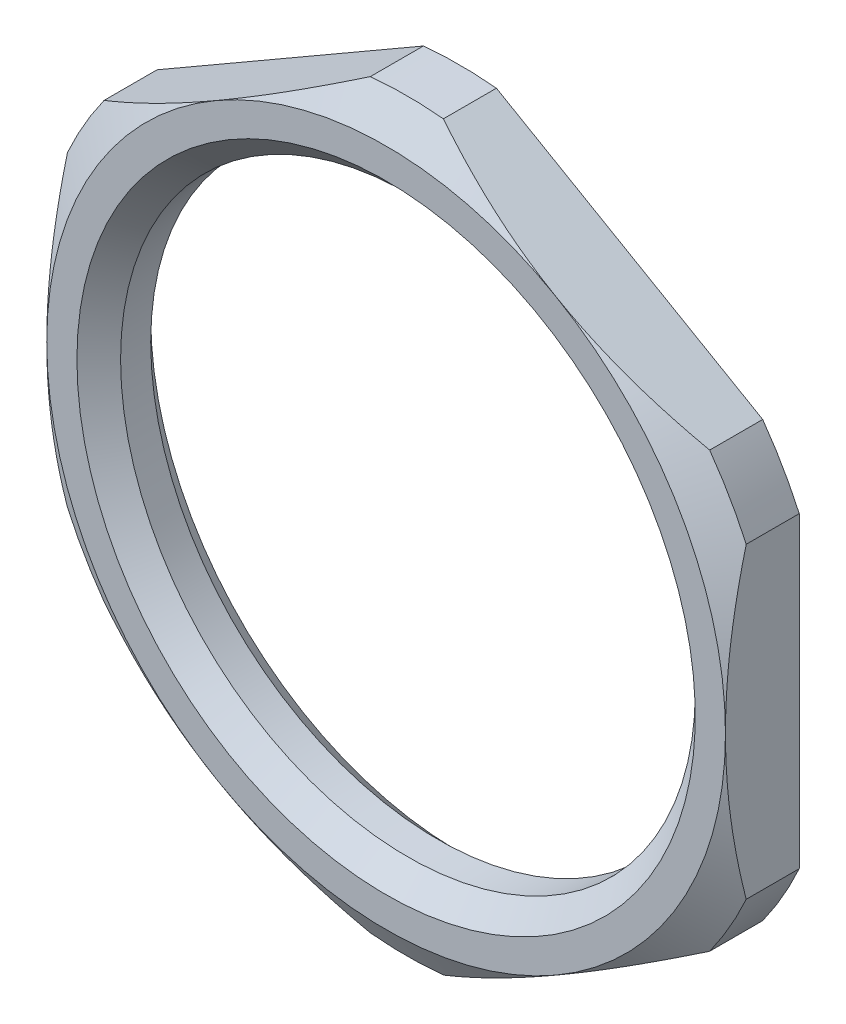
ISO-10303-21;
HEADER;
FILE_DESCRIPTION(('STEP AP214'),'2;1');
FILE_NAME('part.step','',(''),(''),'','','');
FILE_SCHEMA(('AUTOMOTIVE_DESIGN { 1 0 10303 214 1 1 1 1 }'));
ENDSEC;
DATA;
#1=APPLICATION_CONTEXT('core data for automotive mechanical design processes');
#2=APPLICATION_PROTOCOL_DEFINITION('international standard','automotive_design',2000,#1);
#3=PRODUCT_CONTEXT('',#1,'mechanical');
#4=PRODUCT('Part','Part','',(#3));
#5=PRODUCT_RELATED_PRODUCT_CATEGORY('part','',(#4));
#6=PRODUCT_DEFINITION_FORMATION('','',#4);
#7=PRODUCT_DEFINITION_CONTEXT('part definition',#1,'design');
#8=PRODUCT_DEFINITION('design','',#6,#7);
#9=PRODUCT_DEFINITION_SHAPE('','',#8);
#10=(LENGTH_UNIT() NAMED_UNIT(*) SI_UNIT(.MILLI.,.METRE.));
#11=(NAMED_UNIT(*) PLANE_ANGLE_UNIT() SI_UNIT($,.RADIAN.));
#12=(NAMED_UNIT(*) SI_UNIT($,.STERADIAN.) SOLID_ANGLE_UNIT());
#13=UNCERTAINTY_MEASURE_WITH_UNIT(LENGTH_MEASURE(1.E-05),#10,'distance_accuracy_value','');
#14=(GEOMETRIC_REPRESENTATION_CONTEXT(3) GLOBAL_UNCERTAINTY_ASSIGNED_CONTEXT((#13)) GLOBAL_UNIT_ASSIGNED_CONTEXT((#10,
#11,#12)) REPRESENTATION_CONTEXT('',''));
#15=CARTESIAN_POINT('',(0.,0.,0.));
#16=DIRECTION('',(0.,0.,1.));
#17=DIRECTION('',(1.,0.,0.));
#18=AXIS2_PLACEMENT_3D('',#15,#16,#17);
#19=CARTESIAN_POINT('',(0.,20.955,0.));
#20=DIRECTION('',(0.,0.,-1.));
#21=DIRECTION('',(-1.,0.,0.));
#22=AXIS2_PLACEMENT_3D('',#19,#20,#21);
#23=PLANE('',#22);
#24=DIRECTION('',(-0.866025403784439,-0.5,0.));
#25=VECTOR('',#24,1.);
#26=CARTESIAN_POINT('',(-2.42621883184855,25.1573342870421,0.));
#27=LINE('',#26,#25);
#28=CARTESIAN_POINT('',(-2.47659293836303,25.1282507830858,0.));
#29=VERTEX_POINT('',#28);
#30=CARTESIAN_POINT('',(-20.523407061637,14.7089177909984,0.));
#31=VERTEX_POINT('',#30);
#32=EDGE_CURVE('E389',#29,#31,#27,.T.);
#33=ORIENTED_EDGE('',*,*,#32,.F.);
#34=CARTESIAN_POINT('',(0.,3.57353036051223E-13,0.));
#35=DIRECTION('',(0.,0.,-1.));
#36=DIRECTION('',(-1.,0.,0.));
#37=AXIS2_PLACEMENT_3D('',#34,#35,#36);
#38=CIRCLE('',#37,25.2499999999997);
#39=CARTESIAN_POINT('',(2.47659293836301,25.1282507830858,0.));
#40=VERTEX_POINT('',#39);
#41=EDGE_CURVE('E391',#40,#29,#38,.F.);
#42=ORIENTED_EDGE('',*,*,#41,.F.);
#43=DIRECTION('',(-0.866025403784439,0.5,0.));
#44=VECTOR('',#43,1.);
#45=CARTESIAN_POINT('',(2.42621883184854,25.1573342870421,0.));
#46=LINE('',#45,#44);
#47=CARTESIAN_POINT('',(20.523407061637,14.7089177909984,0.));
#48=VERTEX_POINT('',#47);
#49=EDGE_CURVE('E147',#48,#40,#46,.T.);
#50=ORIENTED_EDGE('',*,*,#49,.F.);
#51=CARTESIAN_POINT('',(2.08166817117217E-13,1.07552855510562E-13,0.));
#52=DIRECTION('',(0.,0.,-1.));
#53=DIRECTION('',(-1.,0.,0.));
#54=AXIS2_PLACEMENT_3D('',#51,#52,#53);
#55=CIRCLE('',#54,25.25);
#56=CARTESIAN_POINT('',(23.,10.4193329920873,0.));
#57=VERTEX_POINT('',#56);
#58=EDGE_CURVE('E140',#57,#48,#55,.F.);
#59=ORIENTED_EDGE('',*,*,#58,.F.);
#60=DIRECTION('',(0.,1.,0.));
#61=VECTOR('',#60,1.);
#62=CARTESIAN_POINT('',(23.,20.955,0.));
#63=LINE('',#62,#61);
#64=CARTESIAN_POINT('',(23.,-10.4193329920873,0.));
#65=VERTEX_POINT('',#64);
#66=EDGE_CURVE('E130',#65,#57,#63,.T.);
#67=ORIENTED_EDGE('',*,*,#66,.F.);
#68=CARTESIAN_POINT('',(7.21644966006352E-13,-4.16333634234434E-13,0.));
#69=DIRECTION('',(0.,0.,-1.));
#70=DIRECTION('',(-1.,0.,0.));
#71=AXIS2_PLACEMENT_3D('',#68,#69,#70);
#72=CIRCLE('',#71,25.2499999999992);
#73=CARTESIAN_POINT('',(20.523407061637,-14.7089177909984,0.));
#74=VERTEX_POINT('',#73);
#75=EDGE_CURVE('E119',#74,#65,#72,.F.);
#76=ORIENTED_EDGE('',*,*,#75,.F.);
#77=DIRECTION('',(0.866025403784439,0.5,0.));
#78=VECTOR('',#77,1.);
#79=CARTESIAN_POINT('',(20.5737811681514,-14.6798342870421,0.));
#80=LINE('',#79,#78);
#81=CARTESIAN_POINT('',(2.47659293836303,-25.1282507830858,0.));
#82=VERTEX_POINT('',#81);
#83=EDGE_CURVE('E124',#82,#74,#80,.T.);
#84=ORIENTED_EDGE('',*,*,#83,.F.);
#85=CARTESIAN_POINT('',(0.,-1.03389519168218E-12,0.));
#86=DIRECTION('',(0.,0.,-1.));
#87=DIRECTION('',(-1.,0.,0.));
#88=AXIS2_PLACEMENT_3D('',#85,#86,#87);
#89=CIRCLE('',#88,25.249999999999);
#90=CARTESIAN_POINT('',(-2.47659293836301,-25.1282507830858,0.));
#91=VERTEX_POINT('',#90);
#92=EDGE_CURVE('E379',#91,#82,#89,.F.);
#93=ORIENTED_EDGE('',*,*,#92,.F.);
#94=DIRECTION('',(0.866025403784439,-0.5,0.));
#95=VECTOR('',#94,1.);
#96=CARTESIAN_POINT('',(-20.5737811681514,-14.6798342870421,0.));
#97=LINE('',#96,#95);
#98=CARTESIAN_POINT('',(-20.523407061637,-14.7089177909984,0.));
#99=VERTEX_POINT('',#98);
#100=EDGE_CURVE('E381',#99,#91,#97,.T.);
#101=ORIENTED_EDGE('',*,*,#100,.F.);
#102=CARTESIAN_POINT('',(-4.26741975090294E-13,-2.46330733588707E-13,0.));
#103=DIRECTION('',(0.,0.,-1.));
#104=DIRECTION('',(-1.,0.,0.));
#105=AXIS2_PLACEMENT_3D('',#102,#103,#104);
#106=CIRCLE('',#105,25.2499999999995);
#107=CARTESIAN_POINT('',(-23.,-10.4193329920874,0.));
#108=VERTEX_POINT('',#107);
#109=EDGE_CURVE('E383',#108,#99,#106,.F.);
#110=ORIENTED_EDGE('',*,*,#109,.F.);
#111=DIRECTION('',(0.,-1.,0.));
#112=VECTOR('',#111,1.);
#113=CARTESIAN_POINT('',(-23.,20.955,0.));
#114=LINE('',#113,#112);
#115=CARTESIAN_POINT('',(-23.,10.4193329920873,0.));
#116=VERTEX_POINT('',#115);
#117=EDGE_CURVE('E385',#116,#108,#114,.T.);
#118=ORIENTED_EDGE('',*,*,#117,.F.);
#119=CARTESIAN_POINT('',(-9.64506252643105E-13,5.56846235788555E-13,0.));
#120=DIRECTION('',(0.,0.,-1.));
#121=DIRECTION('',(-1.,0.,0.));
#122=AXIS2_PLACEMENT_3D('',#119,#120,#121);
#123=CIRCLE('',#122,25.2499999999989);
#124=EDGE_CURVE('E387',#31,#116,#123,.F.);
#125=ORIENTED_EDGE('',*,*,#124,.F.);
#126=EDGE_LOOP('',(#33,#42,#50,#59,#67,#76,#84,#93,#101,#110,#118,#125));
#127=FACE_BOUND('',#126,.T.);
#128=CARTESIAN_POINT('',(0.,0.,0.));
#129=DIRECTION('',(0.,0.,-1.));
#130=DIRECTION('',(-1.,0.,0.));
#131=AXIS2_PLACEMENT_3D('',#128,#129,#130);
#132=CIRCLE('',#131,20.955);
#133=CARTESIAN_POINT('',(-20.955,0.,0.));
#134=VERTEX_POINT('',#133);
#135=EDGE_CURVE('E152',#134,#134,#132,.T.);
#136=ORIENTED_EDGE('',*,*,#135,.F.);
#137=EDGE_LOOP('',(#136));
#138=FACE_BOUND('',#137,.T.);
#139=ADVANCED_FACE('F14',(#127,#138),#23,.T.);
#140=CARTESIAN_POINT('',(0.,0.,0.));
#141=DIRECTION('',(0.,0.,-1.));
#142=DIRECTION('',(-1.,0.,0.));
#143=AXIS2_PLACEMENT_3D('',#140,#141,#142);
#144=CONICAL_SURFACE('',#143,31.0016726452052,1.01229096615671);
#145=CARTESIAN_POINT('',(0.,0.,3.59404395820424));
#146=DIRECTION('',(0.,0.,-1.));
#147=DIRECTION('',(-1.,0.,0.));
#148=AXIS2_PLACEMENT_3D('',#145,#146,#147);
#149=CIRCLE('',#148,25.2499999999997);
#150=CARTESIAN_POINT('',(-2.47659293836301,25.1282507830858,3.59404395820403));
#151=VERTEX_POINT('',#150);
#152=CARTESIAN_POINT('',(2.47659293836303,25.1282507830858,3.59404395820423));
#153=VERTEX_POINT('',#152);
#154=EDGE_CURVE('E18',#151,#153,#149,.T.);
#155=ORIENTED_EDGE('',*,*,#154,.F.);
#156=CARTESIAN_POINT('',(-20.523607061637,14.7088023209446,3.59398440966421));
#157=CARTESIAN_POINT('',(-20.0323767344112,14.9924142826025,3.74026185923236));
#158=CARTESIAN_POINT('',(-19.5389969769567,15.2772672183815,3.87724127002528));
#159=CARTESIAN_POINT('',(-18.5480826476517,15.8493718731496,4.13045958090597));
#160=CARTESIAN_POINT('',(-18.0505466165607,16.1366244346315,4.24669084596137));
#161=CARTESIAN_POINT('',(-17.0511867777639,16.7136051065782,4.45629164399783));
#162=CARTESIAN_POINT('',(-16.5493583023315,17.0033359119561,4.54963176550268));
#163=CARTESIAN_POINT('',(-15.5427269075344,17.584514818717,4.71124140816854));
#164=CARTESIAN_POINT('',(-15.0379243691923,17.8759627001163,4.7795140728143));
#165=CARTESIAN_POINT('',(-14.0375910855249,18.4535053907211,4.88813161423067));
#166=CARTESIAN_POINT('',(-13.5421093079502,18.7395719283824,4.92907402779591));
#167=CARTESIAN_POINT('',(-12.5500053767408,19.3123634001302,4.98446926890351));
#168=CARTESIAN_POINT('',(-12.0533831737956,19.5990883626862,4.99892092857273));
#169=CARTESIAN_POINT('',(-11.0605465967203,20.1723028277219,5.00096152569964));
#170=CARTESIAN_POINT('',(-10.5643322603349,20.4587923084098,4.98857476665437));
#171=CARTESIAN_POINT('',(-9.57298362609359,21.0311477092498,4.93730659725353));
#172=CARTESIAN_POINT('',(-9.07784923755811,21.3170136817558,4.89842750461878));
#173=CARTESIAN_POINT('',(-8.07144022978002,21.8980641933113,4.79323232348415));
#174=CARTESIAN_POINT('',(-7.56024092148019,22.1932052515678,4.72596073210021));
#175=CARTESIAN_POINT('',(-6.54086762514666,22.7817406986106,4.56561593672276));
#176=CARTESIAN_POINT('',(-6.03269387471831,23.0751349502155,4.47254073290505));
#177=CARTESIAN_POINT('',(-5.01389388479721,23.6633393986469,4.26137401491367));
#178=CARTESIAN_POINT('',(-4.50331332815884,23.958123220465,4.14299123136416));
#179=CARTESIAN_POINT('',(-3.48653142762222,24.545162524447,3.88432356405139));
#180=CARTESIAN_POINT('',(-2.98032841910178,24.8374189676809,3.74404743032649));
#181=CARTESIAN_POINT('',(-2.47639293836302,25.1283662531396,3.59398440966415));
#182=B_SPLINE_CURVE_WITH_KNOTS('',3,(#156,#157,#158,#159,#160,#161,#162,#163,#164,#165,#166,
#167,#168,#169,#170,#171,#172,#173,#174,#175,#176,#177,#178,#179,#180,#181),.UNSPECIFIED.,.F.,
.F.,(4,2,2,2,2,2,2,2,2,2,2,2,4),(0.,1.75738751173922,3.51542039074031,5.27570036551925,
7.03575952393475,8.75595349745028,10.4762233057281,12.1949359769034,13.9134983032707,
15.6951969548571,17.4770337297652,19.2806029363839,21.0834531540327),.UNSPECIFIED.);
#183=CARTESIAN_POINT('',(-11.5,19.9185842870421,5.));
#184=VERTEX_POINT('',#183);
#185=EDGE_CURVE('E9',#184,#151,#182,.T.);
#186=ORIENTED_EDGE('',*,*,#185,.F.);
#187=CARTESIAN_POINT('',(0.,0.,5.));
#188=DIRECTION('',(0.,0.,-1.));
#189=DIRECTION('',(-1.,0.,0.));
#190=AXIS2_PLACEMENT_3D('',#187,#188,#189);
#191=CIRCLE('',#190,23.);
#192=CARTESIAN_POINT('',(11.5,19.9185842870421,5.));
#193=VERTEX_POINT('',#192);
#194=EDGE_CURVE('E146',#184,#193,#191,.T.);
#195=ORIENTED_EDGE('',*,*,#194,.T.);
#196=CARTESIAN_POINT('',(2.47639293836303,25.1283662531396,3.59398440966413));
#197=CARTESIAN_POINT('',(2.96762326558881,24.8447542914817,3.74026185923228));
#198=CARTESIAN_POINT('',(3.46100302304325,24.5599013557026,3.87724127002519));
#199=CARTESIAN_POINT('',(4.4519173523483,23.9877967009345,4.13045958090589));
#200=CARTESIAN_POINT('',(4.94945338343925,23.7005441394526,4.24669084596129));
#201=CARTESIAN_POINT('',(5.94881322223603,23.123563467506,4.45629164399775));
#202=CARTESIAN_POINT('',(6.45064169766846,22.8338326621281,4.5496317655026));
#203=CARTESIAN_POINT('',(7.45727309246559,22.2526537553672,4.71124140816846));
#204=CARTESIAN_POINT('',(7.96207563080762,21.9612058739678,4.77951407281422));
#205=CARTESIAN_POINT('',(8.9624089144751,21.3836631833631,4.88813161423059));
#206=CARTESIAN_POINT('',(9.45789069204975,21.0975966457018,4.92907402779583));
#207=CARTESIAN_POINT('',(10.4499946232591,20.524805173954,4.98446926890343));
#208=CARTESIAN_POINT('',(10.9466168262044,20.238080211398,4.99892092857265));
#209=CARTESIAN_POINT('',(11.9394534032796,19.6648657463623,5.00096152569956));
#210=CARTESIAN_POINT('',(12.4356677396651,19.3783762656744,4.98857476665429));
#211=CARTESIAN_POINT('',(13.4270163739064,18.8060208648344,4.93730659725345));
#212=CARTESIAN_POINT('',(13.9221507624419,18.5201548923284,4.89842750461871));
#213=CARTESIAN_POINT('',(14.92855977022,17.9391043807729,4.79323232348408));
#214=CARTESIAN_POINT('',(15.4397590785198,17.6439633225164,4.72596073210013));
#215=CARTESIAN_POINT('',(16.4591323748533,17.0554278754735,4.56561593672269));
#216=CARTESIAN_POINT('',(16.9673061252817,16.7620336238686,4.47254073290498));
#217=CARTESIAN_POINT('',(17.9861061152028,16.1738291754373,4.2613740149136));
#218=CARTESIAN_POINT('',(18.4966866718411,15.8790453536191,4.14299123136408));
#219=CARTESIAN_POINT('',(19.5134685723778,15.2920060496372,3.88432356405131));
#220=CARTESIAN_POINT('',(20.0196715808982,14.9997496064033,3.74404743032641));
#221=CARTESIAN_POINT('',(20.523607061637,14.7088023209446,3.59398440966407));
#222=B_SPLINE_CURVE_WITH_KNOTS('',3,(#196,#197,#198,#199,#200,#201,#202,#203,#204,#205,#206,
#207,#208,#209,#210,#211,#212,#213,#214,#215,#216,#217,#218,#219,#220,#221),.UNSPECIFIED.,.F.,
.F.,(4,2,2,2,2,2,2,2,2,2,2,2,4),(0.,1.75738751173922,3.51542039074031,5.27570036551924,
7.03575952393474,8.75595349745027,10.4762233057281,12.1949359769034,13.9134983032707,
15.6951969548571,17.4770337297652,19.2806029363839,21.0834531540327),.UNSPECIFIED.);
#223=EDGE_CURVE('E252',#153,#193,#222,.T.);
#224=ORIENTED_EDGE('',*,*,#223,.F.);
#225=EDGE_LOOP('',(#155,#186,#195,#224));
#226=FACE_BOUND('',#225,.T.);
#227=ADVANCED_FACE('F199',(#226),#144,.T.);
#228=CARTESIAN_POINT('',(-20.523407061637,14.7089177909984,3.59404395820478));
#229=VERTEX_POINT('',#228);
#230=EDGE_CURVE('E23',#229,#184,#182,.T.);
#231=ORIENTED_EDGE('',*,*,#230,.F.);
#232=CARTESIAN_POINT('',(0.,0.,3.59404395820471));
#233=DIRECTION('',(0.,0.,-1.));
#234=DIRECTION('',(-1.,0.,0.));
#235=AXIS2_PLACEMENT_3D('',#232,#233,#234);
#236=CIRCLE('',#235,25.2499999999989);
#237=CARTESIAN_POINT('',(-23.,10.4193329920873,3.59404395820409));
#238=VERTEX_POINT('',#237);
#239=EDGE_CURVE('E246',#238,#229,#236,.T.);
#240=ORIENTED_EDGE('',*,*,#239,.F.);
#241=CARTESIAN_POINT('',(-23.,-31.8496519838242,-5.17670605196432));
#242=CARTESIAN_POINT('',(-23.,-31.4564864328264,-4.97753601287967));
#243=CARTESIAN_POINT('',(-23.,-31.0628139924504,-4.77936724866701));
#244=CARTESIAN_POINT('',(-23.,-30.2743710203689,-4.38521833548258));
#245=CARTESIAN_POINT('',(-23.,-29.8796004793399,-4.18923820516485));
#246=CARTESIAN_POINT('',(-23.,-28.6934436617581,-3.60482471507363));
#247=CARTESIAN_POINT('',(-23.,-27.900293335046,-3.21995945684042));
#248=CARTESIAN_POINT('',(-23.,-26.3063044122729,-2.46050503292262));
#249=CARTESIAN_POINT('',(-23.,-25.505450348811,-2.08594827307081));
#250=CARTESIAN_POINT('',(-23.,-23.8974654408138,-1.35058536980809));
#251=CARTESIAN_POINT('',(-23.,-23.0903347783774,-0.989778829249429));
#252=CARTESIAN_POINT('',(-23.,-21.4417152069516,-0.273015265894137));
#253=CARTESIAN_POINT('',(-23.,-20.5999795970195,0.0823765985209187));
#254=CARTESIAN_POINT('',(-23.,-18.9075684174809,0.771407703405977));
#255=CARTESIAN_POINT('',(-23.,-18.0568924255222,1.10504591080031));
#256=CARTESIAN_POINT('',(-23.,-16.3462024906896,1.74525566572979));
#257=CARTESIAN_POINT('',(-23.,-15.4861975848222,2.05185116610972));
#258=CARTESIAN_POINT('',(-23.,-13.7552474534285,2.6321040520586));
#259=CARTESIAN_POINT('',(-23.,-12.8843036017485,2.90576552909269));
#260=CARTESIAN_POINT('',(-23.,-10.8538744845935,3.49291166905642));
#261=CARTESIAN_POINT('',(-23.,-9.69001120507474,3.79173913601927));
#262=CARTESIAN_POINT('',(-23.,-7.92996265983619,4.1736406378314));
#263=CARTESIAN_POINT('',(-23.,-7.34089843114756,4.28988532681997));
#264=CARTESIAN_POINT('',(-23.,-6.15842397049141,4.49794565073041));
#265=CARTESIAN_POINT('',(-23.,-5.56501376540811,4.58976143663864));
#266=CARTESIAN_POINT('',(-23.,-4.38267576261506,4.74579999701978));
#267=CARTESIAN_POINT('',(-23.,-3.79379498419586,4.81037719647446));
#268=CARTESIAN_POINT('',(-23.,-2.6136556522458,4.91211160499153));
#269=CARTESIAN_POINT('',(-23.,-2.02239712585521,4.94926912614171));
#270=CARTESIAN_POINT('',(-23.,-0.838828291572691,4.99518061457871));
#271=CARTESIAN_POINT('',(-23.,-0.246518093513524,5.00393739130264));
#272=CARTESIAN_POINT('',(-23.,0.937832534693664,4.99281676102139));
#273=CARTESIAN_POINT('',(-23.,1.5298729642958,4.97293929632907));
#274=CARTESIAN_POINT('',(-23.,2.71203937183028,4.90510435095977));
#275=CARTESIAN_POINT('',(-23.,3.30216614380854,4.85716059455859));
#276=CARTESIAN_POINT('',(-23.,4.47960619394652,4.73444095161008));
#277=CARTESIAN_POINT('',(-23.,5.06691944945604,4.65966484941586));
#278=CARTESIAN_POINT('',(-23.,6.23789513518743,4.48504287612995));
#279=CARTESIAN_POINT('',(-23.,6.82155684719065,4.38519222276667));
#280=CARTESIAN_POINT('',(-23.,7.98452759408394,4.16253924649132));
#281=CARTESIAN_POINT('',(-23.,8.56383611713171,4.03973426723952));
#282=CARTESIAN_POINT('',(-23.,9.72515392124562,3.77172646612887));
#283=CARTESIAN_POINT('',(-23.,10.3071004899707,3.62625335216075));
#284=CARTESIAN_POINT('',(-23.,11.4659179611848,3.31646421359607));
#285=CARTESIAN_POINT('',(-23.,12.0427889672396,3.15214857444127));
#286=CARTESIAN_POINT('',(-23.,13.191488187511,2.80692461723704));
#287=CARTESIAN_POINT('',(-23.,13.7633166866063,2.62601724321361));
#288=CARTESIAN_POINT('',(-23.,14.9021426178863,2.24965887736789));
#289=CARTESIAN_POINT('',(-23.,15.4691400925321,2.05420801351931));
#290=CARTESIAN_POINT('',(-23.,16.7228247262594,1.60620786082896));
#291=CARTESIAN_POINT('',(-23.,17.4084017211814,1.35055656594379));
#292=CARTESIAN_POINT('',(-23.,18.7733636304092,0.823250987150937));
#293=CARTESIAN_POINT('',(-23.,19.4527484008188,0.551596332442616));
#294=CARTESIAN_POINT('',(-23.,20.8060603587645,-0.00533185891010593));
#295=CARTESIAN_POINT('',(-23.,21.4799863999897,-0.290608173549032));
#296=CARTESIAN_POINT('',(-23.,22.8228402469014,-0.872693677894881));
#297=CARTESIAN_POINT('',(-23.,23.4917679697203,-1.16950305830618));
#298=CARTESIAN_POINT('',(-23.,24.8069673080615,-1.76471950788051));
#299=CARTESIAN_POINT('',(-23.,25.4533589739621,-2.0628618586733));
#300=CARTESIAN_POINT('',(-23.,26.7423909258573,-2.66715633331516));
#301=CARTESIAN_POINT('',(-23.,27.3850311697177,-2.97330854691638));
#302=CARTESIAN_POINT('',(-23.,28.6663897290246,-3.59224376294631));
#303=CARTESIAN_POINT('',(-23.,29.3051110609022,-3.90502053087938));
#304=CARTESIAN_POINT('',(-23.,30.5795428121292,-4.53657736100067));
#305=CARTESIAN_POINT('',(-23.,31.2152533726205,-4.85535713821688));
#306=CARTESIAN_POINT('',(-23.,31.8496519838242,-5.17670605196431));
#307=B_SPLINE_CURVE_WITH_KNOTS('',3,(#241,#242,#243,#244,#245,#246,#247,#248,#249,#250,#251,
#252,#253,#254,#255,#256,#257,#258,#259,#260,#261,#262,#263,#264,#265,#266,#267,#268,#269,#270,
#271,#272,#273,#274,#275,#276,#277,#278,#279,#280,#281,#282,#283,#284,#285,#286,#287,#288,#289,
#290,#291,#292,#293,#294,#295,#296,#297,#298,#299,#300,#301,#302,#303,#304,#305,#306),
.UNSPECIFIED.,.F.,.F.,(4,2,2,2,2,2,2,2,2,2,2,2,2,2,2,2,2,2,2,2,2,2,2,2,2,2,2,2,2,2,2,2,4),(0.,
1.32220408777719,2.64441943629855,5.28912313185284,7.94136272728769,10.5935256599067,
13.3343333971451,16.0752711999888,18.813756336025,21.5519009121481,25.1535400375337,
26.9543944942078,28.7552378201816,30.5318663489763,32.3084746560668,34.0849072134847,
35.8613433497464,37.6369115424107,39.4124940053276,41.1884153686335,42.9645423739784,
44.7637473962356,46.5629156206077,48.3619815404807,50.1610316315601,52.3558618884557,
54.5507430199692,56.7460737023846,58.9414407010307,61.076887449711,63.2123581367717,
65.3459013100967,67.4793434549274),.UNSPECIFIED.);
#308=CARTESIAN_POINT('',(-23.,0.,5.00000000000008));
#309=VERTEX_POINT('',#308);
#310=EDGE_CURVE('E248',#309,#238,#307,.T.);
#311=ORIENTED_EDGE('',*,*,#310,.F.);
#312=EDGE_CURVE('E141',#309,#184,#191,.T.);
#313=ORIENTED_EDGE('',*,*,#312,.T.);
#314=EDGE_LOOP('',(#231,#240,#311,#313));
#315=FACE_BOUND('',#314,.T.);
#316=ADVANCED_FACE('F204',(#315),#144,.T.);
#317=CARTESIAN_POINT('',(20.523407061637,14.7089177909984,3.59404395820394));
#318=VERTEX_POINT('',#317);
#319=EDGE_CURVE('E256',#193,#318,#222,.T.);
#320=ORIENTED_EDGE('',*,*,#319,.F.);
#321=CARTESIAN_POINT('',(23.,0.,4.99999999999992));
#322=VERTEX_POINT('',#321);
#323=EDGE_CURVE('E153',#193,#322,#191,.T.);
#324=ORIENTED_EDGE('',*,*,#323,.T.);
#325=CARTESIAN_POINT('',(23.,31.8496519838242,-5.17670605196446));
#326=CARTESIAN_POINT('',(23.,31.4564864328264,-4.97753601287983));
#327=CARTESIAN_POINT('',(23.,31.0628139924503,-4.77936724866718));
#328=CARTESIAN_POINT('',(23.,30.2743710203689,-4.38521833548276));
#329=CARTESIAN_POINT('',(23.,29.8796004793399,-4.18923820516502));
#330=CARTESIAN_POINT('',(23.,28.693443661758,-3.60482471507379));
#331=CARTESIAN_POINT('',(23.,27.900293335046,-3.21995945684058));
#332=CARTESIAN_POINT('',(23.,26.3063044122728,-2.46050503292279));
#333=CARTESIAN_POINT('',(23.,25.505450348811,-2.08594827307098));
#334=CARTESIAN_POINT('',(23.,23.8974654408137,-1.35058536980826));
#335=CARTESIAN_POINT('',(23.,23.0903347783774,-0.989778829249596));
#336=CARTESIAN_POINT('',(23.,21.4417152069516,-0.273015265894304));
#337=CARTESIAN_POINT('',(23.,20.5999795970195,0.0823765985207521));
#338=CARTESIAN_POINT('',(23.,18.9075684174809,0.771407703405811));
#339=CARTESIAN_POINT('',(23.,18.0568924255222,1.10504591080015));
#340=CARTESIAN_POINT('',(23.,16.3462024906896,1.74525566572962));
#341=CARTESIAN_POINT('',(23.,15.4861975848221,2.05185116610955));
#342=CARTESIAN_POINT('',(23.,13.7552474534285,2.63210405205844));
#343=CARTESIAN_POINT('',(23.,12.8843036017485,2.90576552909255));
#344=CARTESIAN_POINT('',(23.,10.8538744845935,3.49291166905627));
#345=CARTESIAN_POINT('',(23.,9.6900112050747,3.7917391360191));
#346=CARTESIAN_POINT('',(23.,7.92996265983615,4.17364063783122));
#347=CARTESIAN_POINT('',(23.,7.34089843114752,4.28988532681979));
#348=CARTESIAN_POINT('',(23.,6.15842397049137,4.49794565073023));
#349=CARTESIAN_POINT('',(23.,5.56501376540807,4.58976143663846));
#350=CARTESIAN_POINT('',(23.,4.38267576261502,4.74579999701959));
#351=CARTESIAN_POINT('',(23.,3.79379498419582,4.81037719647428));
#352=CARTESIAN_POINT('',(23.,2.61365565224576,4.91211160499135));
#353=CARTESIAN_POINT('',(23.,2.02239712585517,4.94926912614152));
#354=CARTESIAN_POINT('',(23.,0.83882829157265,4.99518061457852));
#355=CARTESIAN_POINT('',(23.,0.246518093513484,5.00393739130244));
#356=CARTESIAN_POINT('',(23.,-0.937832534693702,4.99281676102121));
#357=CARTESIAN_POINT('',(23.,-1.52987296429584,4.97293929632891));
#358=CARTESIAN_POINT('',(23.,-2.71203937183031,4.90510435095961));
#359=CARTESIAN_POINT('',(23.,-3.30216614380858,4.85716059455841));
#360=CARTESIAN_POINT('',(23.,-4.47960619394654,4.73444095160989));
#361=CARTESIAN_POINT('',(23.,-5.06691944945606,4.65966484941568));
#362=CARTESIAN_POINT('',(23.,-6.23789513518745,4.48504287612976));
#363=CARTESIAN_POINT('',(23.,-6.82155684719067,4.38519222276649));
#364=CARTESIAN_POINT('',(23.,-7.98452759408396,4.16253924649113));
#365=CARTESIAN_POINT('',(23.,-8.56383611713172,4.03973426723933));
#366=CARTESIAN_POINT('',(23.,-9.72515392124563,3.77172646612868));
#367=CARTESIAN_POINT('',(23.,-10.3071004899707,3.62625335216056));
#368=CARTESIAN_POINT('',(23.,-11.4659179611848,3.31646421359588));
#369=CARTESIAN_POINT('',(23.,-12.0427889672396,3.15214857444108));
#370=CARTESIAN_POINT('',(23.,-13.191488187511,2.80692461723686));
#371=CARTESIAN_POINT('',(23.,-13.7633166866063,2.62601724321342));
#372=CARTESIAN_POINT('',(23.,-14.9021426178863,2.24965887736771));
#373=CARTESIAN_POINT('',(23.,-15.4691400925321,2.05420801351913));
#374=CARTESIAN_POINT('',(23.,-16.7228247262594,1.60620786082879));
#375=CARTESIAN_POINT('',(23.,-17.4084017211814,1.35055656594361));
#376=CARTESIAN_POINT('',(23.,-18.7733636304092,0.823250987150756));
#377=CARTESIAN_POINT('',(23.,-19.4527484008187,0.551596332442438));
#378=CARTESIAN_POINT('',(23.,-20.8060603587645,-0.00533185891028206));
#379=CARTESIAN_POINT('',(23.,-21.4799863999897,-0.29060817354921));
#380=CARTESIAN_POINT('',(23.,-22.8228402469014,-0.872693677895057));
#381=CARTESIAN_POINT('',(23.,-23.4917679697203,-1.16950305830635));
#382=CARTESIAN_POINT('',(23.,-24.8069673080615,-1.76471950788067));
#383=CARTESIAN_POINT('',(23.,-25.4533589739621,-2.06286185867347));
#384=CARTESIAN_POINT('',(23.,-26.7423909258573,-2.66715633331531));
#385=CARTESIAN_POINT('',(23.,-27.3850311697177,-2.97330854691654));
#386=CARTESIAN_POINT('',(23.,-28.6663897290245,-3.59224376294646));
#387=CARTESIAN_POINT('',(23.,-29.3051110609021,-3.90502053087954));
#388=CARTESIAN_POINT('',(23.,-30.5795428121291,-4.53657736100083));
#389=CARTESIAN_POINT('',(23.,-31.2152533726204,-4.85535713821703));
#390=CARTESIAN_POINT('',(23.,-31.8496519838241,-5.17670605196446));
#391=B_SPLINE_CURVE_WITH_KNOTS('',3,(#325,#326,#327,#328,#329,#330,#331,#332,#333,#334,#335,
#336,#337,#338,#339,#340,#341,#342,#343,#344,#345,#346,#347,#348,#349,#350,#351,#352,#353,#354,
#355,#356,#357,#358,#359,#360,#361,#362,#363,#364,#365,#366,#367,#368,#369,#370,#371,#372,#373,
#374,#375,#376,#377,#378,#379,#380,#381,#382,#383,#384,#385,#386,#387,#388,#389,#390),
.UNSPECIFIED.,.F.,.F.,(4,2,2,2,2,2,2,2,2,2,2,2,2,2,2,2,2,2,2,2,2,2,2,2,2,2,2,2,2,2,2,2,4),(0.,
1.32220408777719,2.64441943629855,5.28912313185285,7.9413627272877,10.5935256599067,
13.3343333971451,16.0752711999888,18.813756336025,21.5519009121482,25.1535400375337,
26.9543944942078,28.7552378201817,30.5318663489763,32.3084746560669,34.0849072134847,
35.8613433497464,37.6369115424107,39.4124940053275,41.1884153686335,42.9645423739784,
44.7637473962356,46.5629156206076,48.3619815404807,50.16103163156,52.3558618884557,
54.5507430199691,56.7460737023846,58.9414407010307,61.0768874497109,63.2123581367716,
65.3459013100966,67.4793434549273),.UNSPECIFIED.);
#392=CARTESIAN_POINT('',(23.,10.4193329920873,3.59404395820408));
#393=VERTEX_POINT('',#392);
#394=EDGE_CURVE('E354',#393,#322,#391,.T.);
#395=ORIENTED_EDGE('',*,*,#394,.F.);
#396=CARTESIAN_POINT('',(0.,0.,3.59404395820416));
#397=DIRECTION('',(0.,0.,-1.));
#398=DIRECTION('',(-1.,0.,0.));
#399=AXIS2_PLACEMENT_3D('',#396,#397,#398);
#400=CIRCLE('',#399,25.25);
#401=EDGE_CURVE('E272',#318,#393,#400,.T.);
#402=ORIENTED_EDGE('',*,*,#401,.F.);
#403=EDGE_LOOP('',(#320,#324,#395,#402));
#404=FACE_BOUND('',#403,.T.);
#405=ADVANCED_FACE('F334',(#404),#144,.T.);
#406=CARTESIAN_POINT('',(-23.,-10.4193329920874,3.5940439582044));
#407=VERTEX_POINT('',#406);
#408=EDGE_CURVE('E254',#407,#309,#307,.T.);
#409=ORIENTED_EDGE('',*,*,#408,.F.);
#410=CARTESIAN_POINT('',(0.,0.,3.59404395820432));
#411=DIRECTION('',(0.,0.,-1.));
#412=DIRECTION('',(-1.,0.,0.));
#413=AXIS2_PLACEMENT_3D('',#410,#411,#412);
#414=CIRCLE('',#413,25.2499999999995);
#415=CARTESIAN_POINT('',(-20.523407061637,-14.7089177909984,3.59404395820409));
#416=VERTEX_POINT('',#415);
#417=EDGE_CURVE('E264',#416,#407,#414,.T.);
#418=ORIENTED_EDGE('',*,*,#417,.F.);
#419=CARTESIAN_POINT('',(-2.47639293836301,-25.1283662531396,3.59398440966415));
#420=CARTESIAN_POINT('',(-2.96762326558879,-24.8447542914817,3.74026185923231));
#421=CARTESIAN_POINT('',(-3.46100302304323,-24.5599013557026,3.87724127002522));
#422=CARTESIAN_POINT('',(-4.45191735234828,-23.9877967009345,4.13045958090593));
#423=CARTESIAN_POINT('',(-4.94945338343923,-23.7005441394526,4.24669084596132));
#424=CARTESIAN_POINT('',(-5.94881322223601,-23.123563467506,4.45629164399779));
#425=CARTESIAN_POINT('',(-6.45064169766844,-22.8338326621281,4.54963176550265));
#426=CARTESIAN_POINT('',(-7.45727309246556,-22.2526537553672,4.71124140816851));
#427=CARTESIAN_POINT('',(-7.96207563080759,-21.9612058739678,4.77951407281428));
#428=CARTESIAN_POINT('',(-8.96240891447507,-21.3836631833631,4.88813161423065));
#429=CARTESIAN_POINT('',(-9.45789069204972,-21.0975966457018,4.92907402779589));
#430=CARTESIAN_POINT('',(-10.4499946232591,-20.524805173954,4.9844692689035));
#431=CARTESIAN_POINT('',(-10.9466168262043,-20.238080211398,4.99892092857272));
#432=CARTESIAN_POINT('',(-11.9394534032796,-19.6648657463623,5.00096152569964));
#433=CARTESIAN_POINT('',(-12.435667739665,-19.3783762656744,4.98857476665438));
#434=CARTESIAN_POINT('',(-13.4270163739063,-18.8060208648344,4.93730659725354));
#435=CARTESIAN_POINT('',(-13.9221507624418,-18.5201548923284,4.89842750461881));
#436=CARTESIAN_POINT('',(-14.9285597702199,-17.9391043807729,4.79323232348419));
#437=CARTESIAN_POINT('',(-15.4397590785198,-17.6439633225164,4.72596073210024));
#438=CARTESIAN_POINT('',(-16.4591323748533,-17.0554278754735,4.5656159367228));
#439=CARTESIAN_POINT('',(-16.9673061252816,-16.7620336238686,4.47254073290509));
#440=CARTESIAN_POINT('',(-17.9861061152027,-16.1738291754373,4.26137401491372));
#441=CARTESIAN_POINT('',(-18.4966866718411,-15.8790453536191,4.14299123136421));
#442=CARTESIAN_POINT('',(-19.5134685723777,-15.2920060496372,3.88432356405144));
#443=CARTESIAN_POINT('',(-20.0196715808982,-14.9997496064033,3.74404743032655));
#444=CARTESIAN_POINT('',(-20.523607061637,-14.7088023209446,3.59398440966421));
#445=B_SPLINE_CURVE_WITH_KNOTS('',3,(#419,#420,#421,#422,#423,#424,#425,#426,#427,#428,#429,
#430,#431,#432,#433,#434,#435,#436,#437,#438,#439,#440,#441,#442,#443,#444),.UNSPECIFIED.,.F.,
.F.,(4,2,2,2,2,2,2,2,2,2,2,2,4),(0.,1.75738751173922,3.51542039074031,5.27570036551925,
7.03575952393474,8.75595349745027,10.4762233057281,12.1949359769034,13.9134983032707,
15.6951969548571,17.4770337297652,19.2806029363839,21.0834531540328),.UNSPECIFIED.);
#446=CARTESIAN_POINT('',(-11.5,-19.9185842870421,5.));
#447=VERTEX_POINT('',#446);
#448=EDGE_CURVE('E267',#447,#416,#445,.T.);
#449=ORIENTED_EDGE('',*,*,#448,.F.);
#450=EDGE_CURVE('E144',#447,#309,#191,.T.);
#451=ORIENTED_EDGE('',*,*,#450,.T.);
#452=EDGE_LOOP('',(#409,#418,#449,#451));
#453=FACE_BOUND('',#452,.T.);
#454=ADVANCED_FACE('F328',(#453),#144,.T.);
#455=CARTESIAN_POINT('',(-2.47659293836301,-25.1282507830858,3.59404395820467));
#456=VERTEX_POINT('',#455);
#457=EDGE_CURVE('E274',#456,#447,#445,.T.);
#458=ORIENTED_EDGE('',*,*,#457,.F.);
#459=CARTESIAN_POINT('',(0.,0.,3.59404395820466));
#460=DIRECTION('',(0.,0.,-1.));
#461=DIRECTION('',(-1.,0.,0.));
#462=AXIS2_PLACEMENT_3D('',#459,#460,#461);
#463=CIRCLE('',#462,25.249999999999);
#464=CARTESIAN_POINT('',(2.47659293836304,-25.1282507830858,3.59404395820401));
#465=VERTEX_POINT('',#464);
#466=EDGE_CURVE('E280',#465,#456,#463,.T.);
#467=ORIENTED_EDGE('',*,*,#466,.F.);
#468=CARTESIAN_POINT('',(20.523607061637,-14.7088023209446,3.59398440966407));
#469=CARTESIAN_POINT('',(20.0323767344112,-14.9924142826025,3.74026185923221));
#470=CARTESIAN_POINT('',(19.5389969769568,-15.2772672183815,3.87724127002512));
#471=CARTESIAN_POINT('',(18.5480826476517,-15.8493718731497,4.13045958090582));
#472=CARTESIAN_POINT('',(18.0505466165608,-16.1366244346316,4.24669084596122));
#473=CARTESIAN_POINT('',(17.051186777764,-16.7136051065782,4.45629164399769));
#474=CARTESIAN_POINT('',(16.5493583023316,-17.0033359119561,4.54963176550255));
#475=CARTESIAN_POINT('',(15.5427269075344,-17.584514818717,4.71124140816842));
#476=CARTESIAN_POINT('',(15.0379243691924,-17.8759627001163,4.77951407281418));
#477=CARTESIAN_POINT('',(14.0375910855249,-18.4535053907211,4.88813161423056));
#478=CARTESIAN_POINT('',(13.5421093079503,-18.7395719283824,4.9290740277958));
#479=CARTESIAN_POINT('',(12.5500053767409,-19.3123634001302,4.98446926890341));
#480=CARTESIAN_POINT('',(12.0533831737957,-19.5990883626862,4.99892092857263));
#481=CARTESIAN_POINT('',(11.0605465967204,-20.1723028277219,5.00096152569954));
#482=CARTESIAN_POINT('',(10.5643322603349,-20.4587923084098,4.98857476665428));
#483=CARTESIAN_POINT('',(9.57298362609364,-21.0311477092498,4.93730659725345));
#484=CARTESIAN_POINT('',(9.07784923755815,-21.3170136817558,4.89842750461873));
#485=CARTESIAN_POINT('',(8.07144022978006,-21.8980641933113,4.79323232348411));
#486=CARTESIAN_POINT('',(7.56024092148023,-22.1932052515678,4.72596073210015));
#487=CARTESIAN_POINT('',(6.54086762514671,-22.7817406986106,4.5656159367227));
#488=CARTESIAN_POINT('',(6.03269387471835,-23.0751349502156,4.472540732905));
#489=CARTESIAN_POINT('',(5.01389388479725,-23.6633393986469,4.26137401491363));
#490=CARTESIAN_POINT('',(4.50331332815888,-23.958123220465,4.14299123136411));
#491=CARTESIAN_POINT('',(3.48653142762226,-24.545162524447,3.88432356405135));
#492=CARTESIAN_POINT('',(2.98032841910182,-24.8374189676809,3.74404743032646));
#493=CARTESIAN_POINT('',(2.47639293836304,-25.1283662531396,3.59398440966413));
#494=B_SPLINE_CURVE_WITH_KNOTS('',3,(#468,#469,#470,#471,#472,#473,#474,#475,#476,#477,#478,
#479,#480,#481,#482,#483,#484,#485,#486,#487,#488,#489,#490,#491,#492,#493),.UNSPECIFIED.,.F.,
.F.,(4,2,2,2,2,2,2,2,2,2,2,2,4),(0.,1.75738751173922,3.51542039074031,5.27570036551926,
7.03575952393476,8.75595349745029,10.4762233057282,12.1949359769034,13.9134983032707,
15.6951969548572,17.4770337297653,19.2806029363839,21.0834531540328),.UNSPECIFIED.);
#495=CARTESIAN_POINT('',(11.5,-19.9185842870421,5.));
#496=VERTEX_POINT('',#495);
#497=EDGE_CURVE('E175',#496,#465,#494,.T.);
#498=ORIENTED_EDGE('',*,*,#497,.F.);
#499=EDGE_CURVE('E341',#496,#447,#191,.T.);
#500=ORIENTED_EDGE('',*,*,#499,.T.);
#501=EDGE_LOOP('',(#458,#467,#498,#500));
#502=FACE_BOUND('',#501,.T.);
#503=ADVANCED_FACE('F221',(#502),#144,.T.);
#504=CARTESIAN_POINT('',(0.,23.,5.));
#505=DIRECTION('',(0.,0.,1.));
#506=DIRECTION('',(1.,0.,0.));
#507=AXIS2_PLACEMENT_3D('',#504,#505,#506);
#508=PLANE('',#507);
#509=CARTESIAN_POINT('',(0.,0.,5.));
#510=DIRECTION('',(0.,0.,-1.));
#511=DIRECTION('',(-1.,0.,0.));
#512=AXIS2_PLACEMENT_3D('',#509,#510,#511);
#513=CIRCLE('',#512,20.955);
#514=CARTESIAN_POINT('',(-20.955,0.,5.00000000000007));
#515=VERTEX_POINT('',#514);
#516=EDGE_CURVE('E162',#515,#515,#513,.T.);
#517=ORIENTED_EDGE('',*,*,#516,.T.);
#518=EDGE_LOOP('',(#517));
#519=FACE_BOUND('',#518,.T.);
#520=ORIENTED_EDGE('',*,*,#194,.F.);
#521=ORIENTED_EDGE('',*,*,#312,.F.);
#522=ORIENTED_EDGE('',*,*,#450,.F.);
#523=ORIENTED_EDGE('',*,*,#499,.F.);
#524=EDGE_CURVE('E348',#322,#496,#191,.T.);
#525=ORIENTED_EDGE('',*,*,#524,.F.);
#526=ORIENTED_EDGE('',*,*,#323,.F.);
#527=EDGE_LOOP('',(#520,#521,#522,#523,#525,#526));
#528=FACE_BOUND('',#527,.T.);
#529=ADVANCED_FACE('F16',(#519,#528),#508,.T.);
#530=CARTESIAN_POINT('',(0.,0.,5.));
#531=DIRECTION('',(0.,0.,1.));
#532=DIRECTION('',(1.,0.,0.));
#533=AXIS2_PLACEMENT_3D('',#530,#531,#532);
#534=CONICAL_SURFACE('',#533,20.955,0.785398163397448);
#535=CARTESIAN_POINT('',(0.,0.,3.521));
#536=DIRECTION('',(0.,0.,-1.));
#537=DIRECTION('',(-1.,0.,0.));
#538=AXIS2_PLACEMENT_3D('',#535,#536,#537);
#539=CIRCLE('',#538,19.476);
#540=CARTESIAN_POINT('',(-19.476,0.,3.52100000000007));
#541=VERTEX_POINT('',#540);
#542=EDGE_CURVE('E159',#541,#541,#539,.T.);
#543=ORIENTED_EDGE('',*,*,#542,.T.);
#544=EDGE_LOOP('',(#543));
#545=FACE_BOUND('',#544,.T.);
#546=ORIENTED_EDGE('',*,*,#516,.F.);
#547=EDGE_LOOP('',(#546));
#548=FACE_BOUND('',#547,.T.);
#549=ADVANCED_FACE('F213',(#545,#548),#534,.F.);
#550=CARTESIAN_POINT('',(0.,0.,0.));
#551=DIRECTION('',(0.,0.,-1.));
#552=DIRECTION('',(-1.,0.,0.));
#553=AXIS2_PLACEMENT_3D('',#550,#551,#552);
#554=CYLINDRICAL_SURFACE('',#553,19.476);
#555=CARTESIAN_POINT('',(0.,0.,1.479));
#556=DIRECTION('',(0.,0.,-1.));
#557=DIRECTION('',(-1.,0.,0.));
#558=AXIS2_PLACEMENT_3D('',#555,#556,#557);
#559=CIRCLE('',#558,19.476);
#560=CARTESIAN_POINT('',(-19.476,0.,1.47900000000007));
#561=VERTEX_POINT('',#560);
#562=EDGE_CURVE('E156',#561,#561,#559,.T.);
#563=ORIENTED_EDGE('',*,*,#562,.T.);
#564=EDGE_LOOP('',(#563));
#565=FACE_BOUND('',#564,.T.);
#566=ORIENTED_EDGE('',*,*,#542,.F.);
#567=EDGE_LOOP('',(#566));
#568=FACE_BOUND('',#567,.T.);
#569=ADVANCED_FACE('F210',(#565,#568),#554,.F.);
#570=CARTESIAN_POINT('',(0.,0.,1.479));
#571=DIRECTION('',(0.,0.,-1.));
#572=DIRECTION('',(-1.,0.,0.));
#573=AXIS2_PLACEMENT_3D('',#570,#571,#572);
#574=CONICAL_SURFACE('',#573,19.476,0.785398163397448);
#575=ORIENTED_EDGE('',*,*,#135,.T.);
#576=EDGE_LOOP('',(#575));
#577=FACE_BOUND('',#576,.T.);
#578=ORIENTED_EDGE('',*,*,#562,.F.);
#579=EDGE_LOOP('',(#578));
#580=FACE_BOUND('',#579,.T.);
#581=ADVANCED_FACE('F207',(#577,#580),#574,.F.);
#582=CARTESIAN_POINT('',(22.9999999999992,-10.419332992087,3.59404395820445));
#583=VERTEX_POINT('',#582);
#584=EDGE_CURVE('E133',#322,#583,#391,.T.);
#585=ORIENTED_EDGE('',*,*,#584,.F.);
#586=ORIENTED_EDGE('',*,*,#524,.T.);
#587=CARTESIAN_POINT('',(20.523407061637,-14.7089177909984,3.59404395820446));
#588=VERTEX_POINT('',#587);
#589=EDGE_CURVE('E167',#588,#496,#494,.T.);
#590=ORIENTED_EDGE('',*,*,#589,.F.);
#591=CARTESIAN_POINT('',(0.,0.,3.59404395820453));
#592=DIRECTION('',(0.,0.,-1.));
#593=DIRECTION('',(-1.,0.,0.));
#594=AXIS2_PLACEMENT_3D('',#591,#592,#593);
#595=CIRCLE('',#594,25.2499999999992);
#596=EDGE_CURVE('E165',#583,#588,#595,.T.);
#597=ORIENTED_EDGE('',*,*,#596,.F.);
#598=EDGE_LOOP('',(#585,#586,#590,#597));
#599=FACE_BOUND('',#598,.T.);
#600=ADVANCED_FACE('F182',(#599),#144,.T.);
#601=CARTESIAN_POINT('',(23.,10.4193329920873,-6.00000000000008));
#602=DIRECTION('',(-1.,0.,0.));
#603=DIRECTION('',(0.,0.,1.));
#604=AXIS2_PLACEMENT_3D('',#601,#602,#603);
#605=PLANE('',#604);
#606=ORIENTED_EDGE('',*,*,#66,.T.);
#607=DIRECTION('',(0.,0.,1.));
#608=VECTOR('',#607,1.);
#609=CARTESIAN_POINT('',(23.,10.4193329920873,-6.00000000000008));
#610=LINE('',#609,#608);
#611=EDGE_CURVE('E125',#57,#393,#610,.T.);
#612=ORIENTED_EDGE('',*,*,#611,.T.);
#613=ORIENTED_EDGE('',*,*,#394,.T.);
#614=ORIENTED_EDGE('',*,*,#584,.T.);
#615=DIRECTION('',(0.,0.,1.));
#616=VECTOR('',#615,1.);
#617=CARTESIAN_POINT('',(23.,-10.4193329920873,-6.00000000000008));
#618=LINE('',#617,#616);
#619=EDGE_CURVE('E35',#65,#583,#618,.T.);
#620=ORIENTED_EDGE('',*,*,#619,.F.);
#621=EDGE_LOOP('',(#606,#612,#613,#614,#620));
#622=FACE_BOUND('',#621,.T.);
#623=ADVANCED_FACE('F128',(#622),#605,.F.);
#624=CARTESIAN_POINT('',(1.87217929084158E-13,1.07552855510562E-13,-6.));
#625=DIRECTION('',(0.,0.,1.));
#626=DIRECTION('',(1.,0.,0.));
#627=AXIS2_PLACEMENT_3D('',#624,#625,#626);
#628=CYLINDRICAL_SURFACE('',#627,25.25);
#629=ORIENTED_EDGE('',*,*,#58,.T.);
#630=DIRECTION('',(0.,0.,1.));
#631=VECTOR('',#630,1.);
#632=CARTESIAN_POINT('',(20.523407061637,14.7089177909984,-6.00000000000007));
#633=LINE('',#632,#631);
#634=EDGE_CURVE('E357',#48,#318,#633,.T.);
#635=ORIENTED_EDGE('',*,*,#634,.T.);
#636=ORIENTED_EDGE('',*,*,#401,.T.);
#637=ORIENTED_EDGE('',*,*,#611,.F.);
#638=EDGE_LOOP('',(#629,#635,#636,#637));
#639=FACE_BOUND('',#638,.T.);
#640=ADVANCED_FACE('F313',(#639),#628,.T.);
#641=CARTESIAN_POINT('',(2.47659293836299,25.1282507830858,-6.));
#642=DIRECTION('',(-0.5,-0.866025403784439,0.));
#643=DIRECTION('',(-0.866025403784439,0.5,0.));
#644=AXIS2_PLACEMENT_3D('',#641,#642,#643);
#645=PLANE('',#644);
#646=ORIENTED_EDGE('',*,*,#49,.T.);
#647=DIRECTION('',(0.,0.,1.));
#648=VECTOR('',#647,1.);
#649=CARTESIAN_POINT('',(2.47659293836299,25.1282507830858,-6.));
#650=LINE('',#649,#648);
#651=EDGE_CURVE('E359',#40,#153,#650,.T.);
#652=ORIENTED_EDGE('',*,*,#651,.T.);
#653=ORIENTED_EDGE('',*,*,#223,.T.);
#654=ORIENTED_EDGE('',*,*,#319,.T.);
#655=ORIENTED_EDGE('',*,*,#634,.F.);
#656=EDGE_LOOP('',(#646,#652,#653,#654,#655));
#657=FACE_BOUND('',#656,.T.);
#658=ADVANCED_FACE('F309',(#657),#645,.F.);
#659=CARTESIAN_POINT('',(0.,3.57353036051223E-13,-6.));
#660=DIRECTION('',(0.,0.,1.));
#661=DIRECTION('',(1.,0.,0.));
#662=AXIS2_PLACEMENT_3D('',#659,#660,#661);
#663=CYLINDRICAL_SURFACE('',#662,25.2499999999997);
#664=ORIENTED_EDGE('',*,*,#41,.T.);
#665=DIRECTION('',(0.,0.,1.));
#666=VECTOR('',#665,1.);
#667=CARTESIAN_POINT('',(-2.47659293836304,25.1282507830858,-6.));
#668=LINE('',#667,#666);
#669=EDGE_CURVE('E362',#29,#151,#668,.T.);
#670=ORIENTED_EDGE('',*,*,#669,.T.);
#671=ORIENTED_EDGE('',*,*,#154,.T.);
#672=ORIENTED_EDGE('',*,*,#651,.F.);
#673=EDGE_LOOP('',(#664,#670,#671,#672));
#674=FACE_BOUND('',#673,.T.);
#675=ADVANCED_FACE('F299',(#674),#663,.T.);
#676=CARTESIAN_POINT('',(-20.523407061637,14.7089177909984,-5.99999999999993));
#677=DIRECTION('',(0.5,-0.866025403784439,0.));
#678=DIRECTION('',(-0.866025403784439,-0.5,0.));
#679=AXIS2_PLACEMENT_3D('',#676,#677,#678);
#680=PLANE('',#679);
#681=ORIENTED_EDGE('',*,*,#32,.T.);
#682=DIRECTION('',(0.,0.,1.));
#683=VECTOR('',#682,1.);
#684=CARTESIAN_POINT('',(-20.523407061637,14.7089177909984,-5.99999999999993));
#685=LINE('',#684,#683);
#686=EDGE_CURVE('E243',#31,#229,#685,.T.);
#687=ORIENTED_EDGE('',*,*,#686,.T.);
#688=ORIENTED_EDGE('',*,*,#230,.T.);
#689=ORIENTED_EDGE('',*,*,#185,.T.);
#690=ORIENTED_EDGE('',*,*,#669,.F.);
#691=EDGE_LOOP('',(#681,#687,#688,#689,#690));
#692=FACE_BOUND('',#691,.T.);
#693=ADVANCED_FACE('F239',(#692),#680,.F.);
#694=CARTESIAN_POINT('',(-9.85455140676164E-13,5.56846235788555E-13,-6.));
#695=DIRECTION('',(0.,0.,1.));
#696=DIRECTION('',(1.,0.,0.));
#697=AXIS2_PLACEMENT_3D('',#694,#695,#696);
#698=CYLINDRICAL_SURFACE('',#697,25.2499999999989);
#699=ORIENTED_EDGE('',*,*,#124,.T.);
#700=DIRECTION('',(0.,0.,1.));
#701=VECTOR('',#700,1.);
#702=CARTESIAN_POINT('',(-23.,10.4193329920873,-5.99999999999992));
#703=LINE('',#702,#701);
#704=EDGE_CURVE('E367',#116,#238,#703,.T.);
#705=ORIENTED_EDGE('',*,*,#704,.T.);
#706=ORIENTED_EDGE('',*,*,#239,.T.);
#707=ORIENTED_EDGE('',*,*,#686,.F.);
#708=EDGE_LOOP('',(#699,#705,#706,#707));
#709=FACE_BOUND('',#708,.T.);
#710=ADVANCED_FACE('F292',(#709),#698,.T.);
#711=CARTESIAN_POINT('',(-23.,-10.4193329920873,-5.99999999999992));
#712=DIRECTION('',(1.,0.,0.));
#713=DIRECTION('',(0.,0.,-1.));
#714=AXIS2_PLACEMENT_3D('',#711,#712,#713);
#715=PLANE('',#714);
#716=ORIENTED_EDGE('',*,*,#117,.T.);
#717=DIRECTION('',(0.,0.,1.));
#718=VECTOR('',#717,1.);
#719=CARTESIAN_POINT('',(-23.,-10.4193329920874,-5.99999999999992));
#720=LINE('',#719,#718);
#721=EDGE_CURVE('E369',#108,#407,#720,.T.);
#722=ORIENTED_EDGE('',*,*,#721,.T.);
#723=ORIENTED_EDGE('',*,*,#408,.T.);
#724=ORIENTED_EDGE('',*,*,#310,.T.);
#725=ORIENTED_EDGE('',*,*,#704,.F.);
#726=EDGE_LOOP('',(#716,#722,#723,#724,#725));
#727=FACE_BOUND('',#726,.T.);
#728=ADVANCED_FACE('F288',(#727),#715,.F.);
#729=CARTESIAN_POINT('',(-4.47690863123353E-13,-2.46330733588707E-13,-6.));
#730=DIRECTION('',(0.,0.,1.));
#731=DIRECTION('',(1.,0.,0.));
#732=AXIS2_PLACEMENT_3D('',#729,#730,#731);
#733=CYLINDRICAL_SURFACE('',#732,25.2499999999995);
#734=ORIENTED_EDGE('',*,*,#109,.T.);
#735=DIRECTION('',(0.,0.,1.));
#736=VECTOR('',#735,1.);
#737=CARTESIAN_POINT('',(-20.523407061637,-14.7089177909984,-5.99999999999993));
#738=LINE('',#737,#736);
#739=EDGE_CURVE('E371',#99,#416,#738,.T.);
#740=ORIENTED_EDGE('',*,*,#739,.T.);
#741=ORIENTED_EDGE('',*,*,#417,.T.);
#742=ORIENTED_EDGE('',*,*,#721,.F.);
#743=EDGE_LOOP('',(#734,#740,#741,#742));
#744=FACE_BOUND('',#743,.T.);
#745=ADVANCED_FACE('F285',(#744),#733,.T.);
#746=CARTESIAN_POINT('',(-2.47659293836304,-25.1282507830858,-6.));
#747=DIRECTION('',(0.5,0.866025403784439,0.));
#748=DIRECTION('',(0.866025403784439,-0.5,0.));
#749=AXIS2_PLACEMENT_3D('',#746,#747,#748);
#750=PLANE('',#749);
#751=ORIENTED_EDGE('',*,*,#100,.T.);
#752=DIRECTION('',(0.,0.,1.));
#753=VECTOR('',#752,1.);
#754=CARTESIAN_POINT('',(-2.47659293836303,-25.1282507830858,-6.));
#755=LINE('',#754,#753);
#756=EDGE_CURVE('E346',#91,#456,#755,.T.);
#757=ORIENTED_EDGE('',*,*,#756,.T.);
#758=ORIENTED_EDGE('',*,*,#457,.T.);
#759=ORIENTED_EDGE('',*,*,#448,.T.);
#760=ORIENTED_EDGE('',*,*,#739,.F.);
#761=EDGE_LOOP('',(#751,#757,#758,#759,#760));
#762=FACE_BOUND('',#761,.T.);
#763=ADVANCED_FACE('F281',(#762),#750,.F.);
#764=CARTESIAN_POINT('',(0.,-1.03389519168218E-12,-6.));
#765=DIRECTION('',(0.,0.,1.));
#766=DIRECTION('',(1.,0.,0.));
#767=AXIS2_PLACEMENT_3D('',#764,#765,#766);
#768=CYLINDRICAL_SURFACE('',#767,25.249999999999);
#769=ORIENTED_EDGE('',*,*,#92,.T.);
#770=DIRECTION('',(0.,0.,1.));
#771=VECTOR('',#770,1.);
#772=CARTESIAN_POINT('',(2.47659293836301,-25.1282507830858,-6.));
#773=LINE('',#772,#771);
#774=EDGE_CURVE('E374',#82,#465,#773,.T.);
#775=ORIENTED_EDGE('',*,*,#774,.T.);
#776=ORIENTED_EDGE('',*,*,#466,.T.);
#777=ORIENTED_EDGE('',*,*,#756,.F.);
#778=EDGE_LOOP('',(#769,#775,#776,#777));
#779=FACE_BOUND('',#778,.T.);
#780=ADVANCED_FACE('F190',(#779),#768,.T.);
#781=CARTESIAN_POINT('',(20.523407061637,-14.7089177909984,-6.00000000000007));
#782=DIRECTION('',(-0.5,0.866025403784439,0.));
#783=DIRECTION('',(0.866025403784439,0.5,0.));
#784=AXIS2_PLACEMENT_3D('',#781,#782,#783);
#785=PLANE('',#784);
#786=ORIENTED_EDGE('',*,*,#83,.T.);
#787=DIRECTION('',(0.,0.,1.));
#788=VECTOR('',#787,1.);
#789=CARTESIAN_POINT('',(20.523407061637,-14.7089177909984,-6.00000000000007));
#790=LINE('',#789,#788);
#791=EDGE_CURVE('E30',#74,#588,#790,.T.);
#792=ORIENTED_EDGE('',*,*,#791,.T.);
#793=ORIENTED_EDGE('',*,*,#589,.T.);
#794=ORIENTED_EDGE('',*,*,#497,.T.);
#795=ORIENTED_EDGE('',*,*,#774,.F.);
#796=EDGE_LOOP('',(#786,#792,#793,#794,#795));
#797=FACE_BOUND('',#796,.T.);
#798=ADVANCED_FACE('F186',(#797),#785,.F.);
#799=CARTESIAN_POINT('',(7.00696077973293E-13,-4.16333634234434E-13,-6.));
#800=DIRECTION('',(0.,0.,1.));
#801=DIRECTION('',(1.,0.,0.));
#802=AXIS2_PLACEMENT_3D('',#799,#800,#801);
#803=CYLINDRICAL_SURFACE('',#802,25.2499999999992);
#804=ORIENTED_EDGE('',*,*,#75,.T.);
#805=ORIENTED_EDGE('',*,*,#619,.T.);
#806=ORIENTED_EDGE('',*,*,#596,.T.);
#807=ORIENTED_EDGE('',*,*,#791,.F.);
#808=EDGE_LOOP('',(#804,#805,#806,#807));
#809=FACE_BOUND('',#808,.T.);
#810=ADVANCED_FACE('F120',(#809),#803,.T.);
#811=CLOSED_SHELL('',(#139,#227,#316,#405,#454,#503,#529,#549,#569,#581,#600,#623,#640,#658,
#675,#693,#710,#728,#745,#763,#780,#798,#810));
#812=MANIFOLD_SOLID_BREP('B1',#811);
#813=ADVANCED_BREP_SHAPE_REPRESENTATION('',(#18,#812),#14);
#814=SHAPE_DEFINITION_REPRESENTATION(#9,#813);
ENDSEC;
END-ISO-10303-21;
